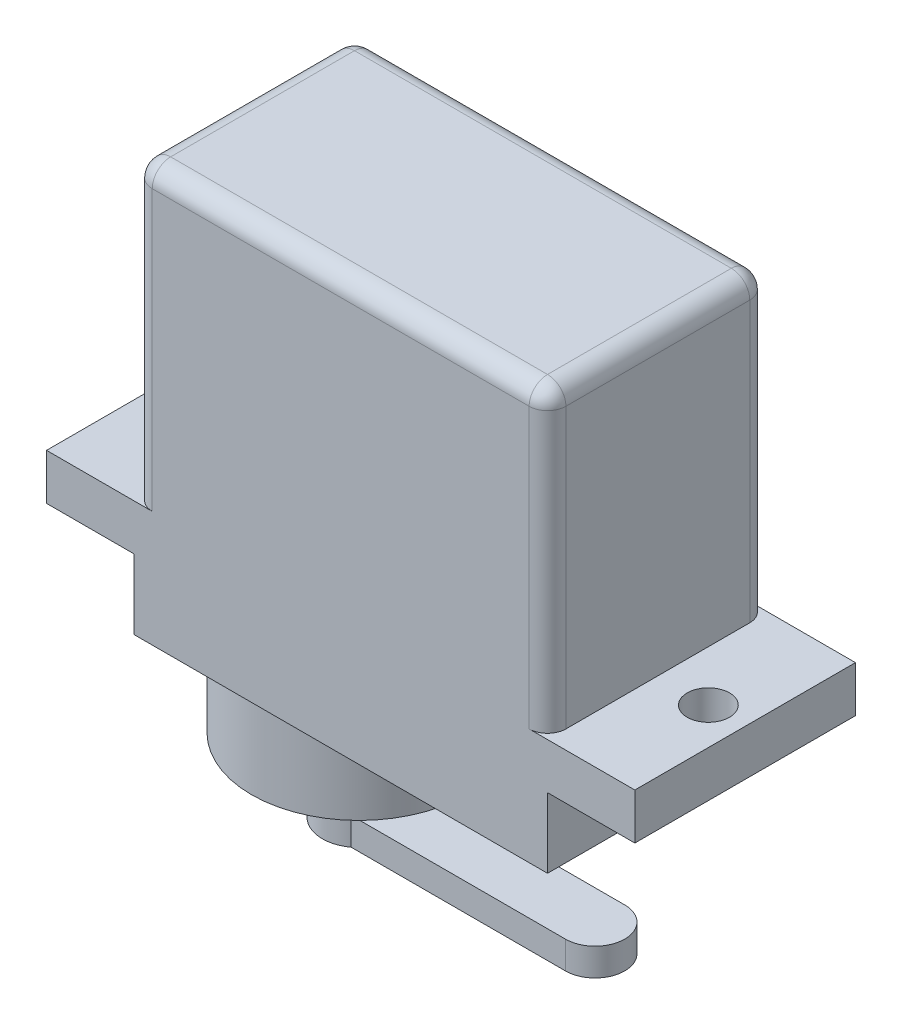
ISO-10303-21;
HEADER;
FILE_DESCRIPTION(('STEP AP214'),'2;1');
FILE_NAME('part.step','',(''),(''),'','','');
FILE_SCHEMA(('AUTOMOTIVE_DESIGN { 1 0 10303 214 1 1 1 1 }'));
ENDSEC;
DATA;
#1=APPLICATION_CONTEXT('core data for automotive mechanical design processes');
#2=APPLICATION_PROTOCOL_DEFINITION('international standard','automotive_design',2000,#1);
#3=PRODUCT_CONTEXT('',#1,'mechanical');
#4=PRODUCT('Part','Part','',(#3));
#5=PRODUCT_RELATED_PRODUCT_CATEGORY('part','',(#4));
#6=PRODUCT_DEFINITION_FORMATION('','',#4);
#7=PRODUCT_DEFINITION_CONTEXT('part definition',#1,'design');
#8=PRODUCT_DEFINITION('design','',#6,#7);
#9=PRODUCT_DEFINITION_SHAPE('','',#8);
#10=(LENGTH_UNIT() NAMED_UNIT(*) SI_UNIT(.MILLI.,.METRE.));
#11=(NAMED_UNIT(*) PLANE_ANGLE_UNIT() SI_UNIT($,.RADIAN.));
#12=(NAMED_UNIT(*) SI_UNIT($,.STERADIAN.) SOLID_ANGLE_UNIT());
#13=UNCERTAINTY_MEASURE_WITH_UNIT(LENGTH_MEASURE(1.E-05),#10,'distance_accuracy_value','');
#14=(GEOMETRIC_REPRESENTATION_CONTEXT(3) GLOBAL_UNCERTAINTY_ASSIGNED_CONTEXT((#13)) GLOBAL_UNIT_ASSIGNED_CONTEXT((#10,
#11,#12)) REPRESENTATION_CONTEXT('',''));
#15=CARTESIAN_POINT('',(0.,0.,0.));
#16=DIRECTION('',(0.,0.,1.));
#17=DIRECTION('',(1.,0.,0.));
#18=AXIS2_PLACEMENT_3D('',#15,#16,#17);
#19=CARTESIAN_POINT('',(11.25,3.8,6.));
#20=DIRECTION('',(-1.,0.,0.));
#21=DIRECTION('',(0.,-1.,0.));
#22=AXIS2_PLACEMENT_3D('',#19,#20,#21);
#23=PLANE('',#22);
#24=DIRECTION('',(0.,1.,0.));
#25=VECTOR('',#24,1.);
#26=CARTESIAN_POINT('',(11.25,3.8,-6.));
#27=LINE('',#26,#25);
#28=CARTESIAN_POINT('',(11.25,0.,-6.));
#29=VERTEX_POINT('',#28);
#30=CARTESIAN_POINT('',(11.25,3.8,-6.));
#31=VERTEX_POINT('',#30);
#32=EDGE_CURVE('E268',#29,#31,#27,.T.);
#33=ORIENTED_EDGE('',*,*,#32,.T.);
#34=DIRECTION('',(0.,0.,-1.));
#35=VECTOR('',#34,1.);
#36=CARTESIAN_POINT('',(11.25,3.8,6.));
#37=LINE('',#36,#35);
#38=CARTESIAN_POINT('',(11.25,3.8,6.));
#39=VERTEX_POINT('',#38);
#40=EDGE_CURVE('E307',#39,#31,#37,.T.);
#41=ORIENTED_EDGE('',*,*,#40,.F.);
#42=DIRECTION('',(0.,1.,0.));
#43=VECTOR('',#42,1.);
#44=CARTESIAN_POINT('',(11.25,3.8,6.));
#45=LINE('',#44,#43);
#46=CARTESIAN_POINT('',(11.25,0.,6.));
#47=VERTEX_POINT('',#46);
#48=EDGE_CURVE('E249',#47,#39,#45,.T.);
#49=ORIENTED_EDGE('',*,*,#48,.F.);
#50=DIRECTION('',(0.,0.,-1.));
#51=VECTOR('',#50,1.);
#52=CARTESIAN_POINT('',(11.25,0.,6.));
#53=LINE('',#52,#51);
#54=EDGE_CURVE('E236',#47,#29,#53,.T.);
#55=ORIENTED_EDGE('',*,*,#54,.T.);
#56=EDGE_LOOP('',(#33,#41,#49,#55));
#57=FACE_BOUND('',#56,.T.);
#58=ADVANCED_FACE('F37',(#57),#23,.F.);
#59=CARTESIAN_POINT('',(16.,3.8,6.));
#60=DIRECTION('',(0.,1.,0.));
#61=DIRECTION('',(-1.,0.,0.));
#62=AXIS2_PLACEMENT_3D('',#59,#60,#61);
#63=PLANE('',#62);
#64=CARTESIAN_POINT('',(14.,3.8,0.));
#65=DIRECTION('',(0.,-1.,0.));
#66=DIRECTION('',(-1.,0.,0.));
#67=AXIS2_PLACEMENT_3D('',#64,#65,#66);
#68=CIRCLE('',#67,1.15);
#69=CARTESIAN_POINT('',(12.85,3.8,0.));
#70=VERTEX_POINT('',#69);
#71=EDGE_CURVE('E233',#70,#70,#68,.T.);
#72=ORIENTED_EDGE('',*,*,#71,.F.);
#73=EDGE_LOOP('',(#72));
#74=FACE_BOUND('',#73,.T.);
#75=DIRECTION('',(1.,0.,0.));
#76=VECTOR('',#75,1.);
#77=CARTESIAN_POINT('',(16.,3.8,-6.));
#78=LINE('',#77,#76);
#79=CARTESIAN_POINT('',(16.,3.8,-6.));
#80=VERTEX_POINT('',#79);
#81=EDGE_CURVE('E270',#31,#80,#78,.T.);
#82=ORIENTED_EDGE('',*,*,#81,.T.);
#83=DIRECTION('',(0.,0.,-1.));
#84=VECTOR('',#83,1.);
#85=CARTESIAN_POINT('',(16.,3.8,6.));
#86=LINE('',#85,#84);
#87=CARTESIAN_POINT('',(16.,3.8,6.));
#88=VERTEX_POINT('',#87);
#89=EDGE_CURVE('E304',#88,#80,#86,.T.);
#90=ORIENTED_EDGE('',*,*,#89,.F.);
#91=DIRECTION('',(1.,0.,0.));
#92=VECTOR('',#91,1.);
#93=CARTESIAN_POINT('',(16.,3.8,6.));
#94=LINE('',#93,#92);
#95=EDGE_CURVE('E252',#39,#88,#94,.T.);
#96=ORIENTED_EDGE('',*,*,#95,.F.);
#97=ORIENTED_EDGE('',*,*,#40,.T.);
#98=EDGE_LOOP('',(#82,#90,#96,#97));
#99=FACE_BOUND('',#98,.T.);
#100=ADVANCED_FACE('F454',(#74,#99),#63,.F.);
#101=CARTESIAN_POINT('',(16.,6.3,6.));
#102=DIRECTION('',(-1.,0.,0.));
#103=DIRECTION('',(0.,0.,1.));
#104=AXIS2_PLACEMENT_3D('',#101,#102,#103);
#105=PLANE('',#104);
#106=DIRECTION('',(0.,1.,0.));
#107=VECTOR('',#106,1.);
#108=CARTESIAN_POINT('',(16.,6.3,-6.));
#109=LINE('',#108,#107);
#110=CARTESIAN_POINT('',(16.,6.3,-6.));
#111=VERTEX_POINT('',#110);
#112=EDGE_CURVE('E272',#80,#111,#109,.T.);
#113=ORIENTED_EDGE('',*,*,#112,.T.);
#114=DIRECTION('',(0.,0.,-1.));
#115=VECTOR('',#114,1.);
#116=CARTESIAN_POINT('',(16.,6.3,6.));
#117=LINE('',#116,#115);
#118=CARTESIAN_POINT('',(16.,6.3,6.));
#119=VERTEX_POINT('',#118);
#120=EDGE_CURVE('E301',#119,#111,#117,.T.);
#121=ORIENTED_EDGE('',*,*,#120,.F.);
#122=DIRECTION('',(0.,1.,0.));
#123=VECTOR('',#122,1.);
#124=CARTESIAN_POINT('',(16.,6.3,6.));
#125=LINE('',#124,#123);
#126=EDGE_CURVE('E254',#88,#119,#125,.T.);
#127=ORIENTED_EDGE('',*,*,#126,.F.);
#128=ORIENTED_EDGE('',*,*,#89,.T.);
#129=EDGE_LOOP('',(#113,#121,#127,#128));
#130=FACE_BOUND('',#129,.T.);
#131=ADVANCED_FACE('F460',(#130),#105,.F.);
#132=CARTESIAN_POINT('',(11.25,6.3,6.));
#133=DIRECTION('',(0.,-1.,0.));
#134=DIRECTION('',(1.,0.,0.));
#135=AXIS2_PLACEMENT_3D('',#132,#133,#134);
#136=PLANE('',#135);
#137=CARTESIAN_POINT('',(14.,6.3,0.));
#138=DIRECTION('',(0.,-1.,0.));
#139=DIRECTION('',(1.,0.,0.));
#140=AXIS2_PLACEMENT_3D('',#137,#138,#139);
#141=CIRCLE('',#140,1.15);
#142=CARTESIAN_POINT('',(15.15,6.3,0.));
#143=VERTEX_POINT('',#142);
#144=EDGE_CURVE('E245',#143,#143,#141,.T.);
#145=ORIENTED_EDGE('',*,*,#144,.T.);
#146=EDGE_LOOP('',(#145));
#147=FACE_BOUND('',#146,.T.);
#148=DIRECTION('',(-1.,0.,0.));
#149=VECTOR('',#148,1.);
#150=CARTESIAN_POINT('',(11.25,6.3,-6.));
#151=LINE('',#150,#149);
#152=CARTESIAN_POINT('',(10.25,6.3,-6.));
#153=VERTEX_POINT('',#152);
#154=EDGE_CURVE('E274',#111,#153,#151,.T.);
#155=ORIENTED_EDGE('',*,*,#154,.T.);
#156=CARTESIAN_POINT('',(10.25,6.3,-5.));
#157=DIRECTION('',(0.,-1.,0.));
#158=DIRECTION('',(1.,0.,0.));
#159=AXIS2_PLACEMENT_3D('',#156,#157,#158);
#160=CIRCLE('',#159,1.);
#161=CARTESIAN_POINT('',(11.25,6.3,-5.));
#162=VERTEX_POINT('',#161);
#163=EDGE_CURVE('E352',#153,#162,#160,.T.);
#164=ORIENTED_EDGE('',*,*,#163,.T.);
#165=DIRECTION('',(0.,0.,-1.));
#166=VECTOR('',#165,1.);
#167=CARTESIAN_POINT('',(11.25,6.3,6.));
#168=LINE('',#167,#166);
#169=CARTESIAN_POINT('',(11.25,6.3,5.));
#170=VERTEX_POINT('',#169);
#171=EDGE_CURVE('E298',#170,#162,#168,.T.);
#172=ORIENTED_EDGE('',*,*,#171,.F.);
#173=CARTESIAN_POINT('',(10.25,6.3,5.));
#174=DIRECTION('',(0.,-1.,0.));
#175=DIRECTION('',(1.,0.,0.));
#176=AXIS2_PLACEMENT_3D('',#173,#174,#175);
#177=CIRCLE('',#176,1.);
#178=CARTESIAN_POINT('',(10.25,6.3,6.));
#179=VERTEX_POINT('',#178);
#180=EDGE_CURVE('E46',#170,#179,#177,.T.);
#181=ORIENTED_EDGE('',*,*,#180,.T.);
#182=DIRECTION('',(-1.,0.,0.));
#183=VECTOR('',#182,1.);
#184=CARTESIAN_POINT('',(11.25,6.3,6.));
#185=LINE('',#184,#183);
#186=EDGE_CURVE('E256',#119,#179,#185,.T.);
#187=ORIENTED_EDGE('',*,*,#186,.F.);
#188=ORIENTED_EDGE('',*,*,#120,.T.);
#189=EDGE_LOOP('',(#155,#164,#172,#181,#187,#188));
#190=FACE_BOUND('',#189,.T.);
#191=ADVANCED_FACE('F702',(#147,#190),#136,.F.);
#192=CARTESIAN_POINT('',(11.25,22.5,6.));
#193=DIRECTION('',(-1.,0.,0.));
#194=DIRECTION('',(0.,0.,1.));
#195=AXIS2_PLACEMENT_3D('',#192,#193,#194);
#196=PLANE('',#195);
#197=ORIENTED_EDGE('',*,*,#171,.T.);
#198=DIRECTION('',(0.,1.,0.));
#199=VECTOR('',#198,1.);
#200=CARTESIAN_POINT('',(11.25,22.5,-5.));
#201=LINE('',#200,#199);
#202=CARTESIAN_POINT('',(11.25,21.5,-5.));
#203=VERTEX_POINT('',#202);
#204=EDGE_CURVE('E329',#162,#203,#201,.T.);
#205=ORIENTED_EDGE('',*,*,#204,.T.);
#206=DIRECTION('',(0.,0.,-1.));
#207=VECTOR('',#206,1.);
#208=CARTESIAN_POINT('',(11.25,21.5,6.));
#209=LINE('',#208,#207);
#210=CARTESIAN_POINT('',(11.25,21.5,5.));
#211=VERTEX_POINT('',#210);
#212=EDGE_CURVE('E326',#203,#211,#209,.F.);
#213=ORIENTED_EDGE('',*,*,#212,.T.);
#214=DIRECTION('',(0.,1.,0.));
#215=VECTOR('',#214,1.);
#216=CARTESIAN_POINT('',(11.25,22.5,5.));
#217=LINE('',#216,#215);
#218=EDGE_CURVE('E324',#211,#170,#217,.F.);
#219=ORIENTED_EDGE('',*,*,#218,.T.);
#220=EDGE_LOOP('',(#197,#205,#213,#219));
#221=FACE_BOUND('',#220,.T.);
#222=ADVANCED_FACE('F714',(#221),#196,.F.);
#223=CARTESIAN_POINT('',(-11.25,22.5,6.));
#224=DIRECTION('',(0.,-1.,0.));
#225=DIRECTION('',(0.,0.,-1.));
#226=AXIS2_PLACEMENT_3D('',#223,#224,#225);
#227=PLANE('',#226);
#228=DIRECTION('',(-1.,0.,0.));
#229=VECTOR('',#228,1.);
#230=CARTESIAN_POINT('',(-11.25,22.5,5.));
#231=LINE('',#230,#229);
#232=CARTESIAN_POINT('',(-10.25,22.5,5.));
#233=VERTEX_POINT('',#232);
#234=CARTESIAN_POINT('',(10.25,22.5,5.));
#235=VERTEX_POINT('',#234);
#236=EDGE_CURVE('E319',#233,#235,#231,.F.);
#237=ORIENTED_EDGE('',*,*,#236,.T.);
#238=DIRECTION('',(0.,0.,-1.));
#239=VECTOR('',#238,1.);
#240=CARTESIAN_POINT('',(10.25,22.5,6.));
#241=LINE('',#240,#239);
#242=CARTESIAN_POINT('',(10.25,22.5,-5.));
#243=VERTEX_POINT('',#242);
#244=EDGE_CURVE('E321',#235,#243,#241,.T.);
#245=ORIENTED_EDGE('',*,*,#244,.T.);
#246=DIRECTION('',(-1.,0.,0.));
#247=VECTOR('',#246,1.);
#248=CARTESIAN_POINT('',(-11.25,22.5,-5.));
#249=LINE('',#248,#247);
#250=CARTESIAN_POINT('',(-10.25,22.5,-5.));
#251=VERTEX_POINT('',#250);
#252=EDGE_CURVE('E315',#243,#251,#249,.T.);
#253=ORIENTED_EDGE('',*,*,#252,.T.);
#254=DIRECTION('',(0.,0.,-1.));
#255=VECTOR('',#254,1.);
#256=CARTESIAN_POINT('',(-10.25,22.5,6.));
#257=LINE('',#256,#255);
#258=EDGE_CURVE('E317',#251,#233,#257,.F.);
#259=ORIENTED_EDGE('',*,*,#258,.T.);
#260=EDGE_LOOP('',(#237,#245,#253,#259));
#261=FACE_BOUND('',#260,.T.);
#262=ADVANCED_FACE('F402',(#261),#227,.F.);
#263=CARTESIAN_POINT('',(-11.25,6.3,6.));
#264=DIRECTION('',(1.,0.,0.));
#265=DIRECTION('',(0.,0.,-1.));
#266=AXIS2_PLACEMENT_3D('',#263,#264,#265);
#267=PLANE('',#266);
#268=DIRECTION('',(0.,0.,-1.));
#269=VECTOR('',#268,1.);
#270=CARTESIAN_POINT('',(-11.25,21.5,6.));
#271=LINE('',#270,#269);
#272=CARTESIAN_POINT('',(-11.25,21.5,5.));
#273=VERTEX_POINT('',#272);
#274=CARTESIAN_POINT('',(-11.25,21.5,-5.));
#275=VERTEX_POINT('',#274);
#276=EDGE_CURVE('E340',#273,#275,#271,.T.);
#277=ORIENTED_EDGE('',*,*,#276,.T.);
#278=DIRECTION('',(0.,-1.,0.));
#279=VECTOR('',#278,1.);
#280=CARTESIAN_POINT('',(-11.25,6.3,-5.));
#281=LINE('',#280,#279);
#282=CARTESIAN_POINT('',(-11.25,6.3,-5.));
#283=VERTEX_POINT('',#282);
#284=EDGE_CURVE('E342',#275,#283,#281,.T.);
#285=ORIENTED_EDGE('',*,*,#284,.T.);
#286=DIRECTION('',(0.,0.,-1.));
#287=VECTOR('',#286,1.);
#288=CARTESIAN_POINT('',(-11.25,6.3,6.));
#289=LINE('',#288,#287);
#290=CARTESIAN_POINT('',(-11.25,6.3,5.));
#291=VERTEX_POINT('',#290);
#292=EDGE_CURVE('E295',#291,#283,#289,.T.);
#293=ORIENTED_EDGE('',*,*,#292,.F.);
#294=DIRECTION('',(0.,-1.,0.));
#295=VECTOR('',#294,1.);
#296=CARTESIAN_POINT('',(-11.25,6.3,5.));
#297=LINE('',#296,#295);
#298=EDGE_CURVE('E338',#291,#273,#297,.F.);
#299=ORIENTED_EDGE('',*,*,#298,.T.);
#300=EDGE_LOOP('',(#277,#285,#293,#299));
#301=FACE_BOUND('',#300,.T.);
#302=ADVANCED_FACE('F412',(#301),#267,.F.);
#303=CARTESIAN_POINT('',(-16.,6.3,6.));
#304=DIRECTION('',(0.,-1.,0.));
#305=DIRECTION('',(1.,0.,0.));
#306=AXIS2_PLACEMENT_3D('',#303,#304,#305);
#307=PLANE('',#306);
#308=CARTESIAN_POINT('',(-14.,6.3,0.));
#309=DIRECTION('',(0.,-1.,0.));
#310=DIRECTION('',(1.,0.,0.));
#311=AXIS2_PLACEMENT_3D('',#308,#309,#310);
#312=CIRCLE('',#311,1.15);
#313=CARTESIAN_POINT('',(-12.85,6.3,0.));
#314=VERTEX_POINT('',#313);
#315=EDGE_CURVE('E240',#314,#314,#312,.T.);
#316=ORIENTED_EDGE('',*,*,#315,.T.);
#317=EDGE_LOOP('',(#316));
#318=FACE_BOUND('',#317,.T.);
#319=DIRECTION('',(-1.,0.,0.));
#320=VECTOR('',#319,1.);
#321=CARTESIAN_POINT('',(-16.,6.3,-6.));
#322=LINE('',#321,#320);
#323=CARTESIAN_POINT('',(-10.25,6.3,-6.));
#324=VERTEX_POINT('',#323);
#325=CARTESIAN_POINT('',(-16.,6.3,-6.));
#326=VERTEX_POINT('',#325);
#327=EDGE_CURVE('E54',#324,#326,#322,.T.);
#328=ORIENTED_EDGE('',*,*,#327,.T.);
#329=DIRECTION('',(0.,0.,-1.));
#330=VECTOR('',#329,1.);
#331=CARTESIAN_POINT('',(-16.,6.3,6.));
#332=LINE('',#331,#330);
#333=CARTESIAN_POINT('',(-16.,6.3,6.));
#334=VERTEX_POINT('',#333);
#335=EDGE_CURVE('E292',#334,#326,#332,.T.);
#336=ORIENTED_EDGE('',*,*,#335,.F.);
#337=DIRECTION('',(-1.,0.,0.));
#338=VECTOR('',#337,1.);
#339=CARTESIAN_POINT('',(-16.,6.3,6.));
#340=LINE('',#339,#338);
#341=CARTESIAN_POINT('',(-10.25,6.3,6.));
#342=VERTEX_POINT('',#341);
#343=EDGE_CURVE('E258',#342,#334,#340,.T.);
#344=ORIENTED_EDGE('',*,*,#343,.F.);
#345=CARTESIAN_POINT('',(-10.25,6.3,5.));
#346=DIRECTION('',(0.,-1.,0.));
#347=DIRECTION('',(1.,0.,0.));
#348=AXIS2_PLACEMENT_3D('',#345,#346,#347);
#349=CIRCLE('',#348,1.);
#350=EDGE_CURVE('E11',#342,#291,#349,.T.);
#351=ORIENTED_EDGE('',*,*,#350,.T.);
#352=ORIENTED_EDGE('',*,*,#292,.T.);
#353=CARTESIAN_POINT('',(-10.25,6.3,-5.));
#354=DIRECTION('',(0.,-1.,0.));
#355=DIRECTION('',(1.,0.,0.));
#356=AXIS2_PLACEMENT_3D('',#353,#354,#355);
#357=CIRCLE('',#356,1.);
#358=EDGE_CURVE('E350',#283,#324,#357,.T.);
#359=ORIENTED_EDGE('',*,*,#358,.T.);
#360=EDGE_LOOP('',(#328,#336,#344,#351,#352,#359));
#361=FACE_BOUND('',#360,.T.);
#362=ADVANCED_FACE('F419',(#318,#361),#307,.F.);
#363=CARTESIAN_POINT('',(-16.,3.8,6.));
#364=DIRECTION('',(1.,0.,0.));
#365=DIRECTION('',(0.,0.,-1.));
#366=AXIS2_PLACEMENT_3D('',#363,#364,#365);
#367=PLANE('',#366);
#368=DIRECTION('',(0.,-1.,0.));
#369=VECTOR('',#368,1.);
#370=CARTESIAN_POINT('',(-16.,3.8,-6.));
#371=LINE('',#370,#369);
#372=CARTESIAN_POINT('',(-16.,3.8,-6.));
#373=VERTEX_POINT('',#372);
#374=EDGE_CURVE('E277',#326,#373,#371,.T.);
#375=ORIENTED_EDGE('',*,*,#374,.T.);
#376=DIRECTION('',(0.,0.,-1.));
#377=VECTOR('',#376,1.);
#378=CARTESIAN_POINT('',(-16.,3.8,6.));
#379=LINE('',#378,#377);
#380=CARTESIAN_POINT('',(-16.,3.8,6.));
#381=VERTEX_POINT('',#380);
#382=EDGE_CURVE('E289',#381,#373,#379,.T.);
#383=ORIENTED_EDGE('',*,*,#382,.F.);
#384=DIRECTION('',(0.,-1.,0.));
#385=VECTOR('',#384,1.);
#386=CARTESIAN_POINT('',(-16.,3.8,6.));
#387=LINE('',#386,#385);
#388=EDGE_CURVE('E260',#334,#381,#387,.T.);
#389=ORIENTED_EDGE('',*,*,#388,.F.);
#390=ORIENTED_EDGE('',*,*,#335,.T.);
#391=EDGE_LOOP('',(#375,#383,#389,#390));
#392=FACE_BOUND('',#391,.T.);
#393=ADVANCED_FACE('F667',(#392),#367,.F.);
#394=CARTESIAN_POINT('',(-11.25,3.8,6.));
#395=DIRECTION('',(0.,1.,0.));
#396=DIRECTION('',(-1.,0.,0.));
#397=AXIS2_PLACEMENT_3D('',#394,#395,#396);
#398=PLANE('',#397);
#399=CARTESIAN_POINT('',(-14.,3.80000000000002,0.));
#400=DIRECTION('',(0.,-1.,0.));
#401=DIRECTION('',(1.,0.,0.));
#402=AXIS2_PLACEMENT_3D('',#399,#400,#401);
#403=CIRCLE('',#402,1.15);
#404=CARTESIAN_POINT('',(-12.85,3.80000000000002,0.));
#405=VERTEX_POINT('',#404);
#406=EDGE_CURVE('E237',#405,#405,#403,.T.);
#407=ORIENTED_EDGE('',*,*,#406,.F.);
#408=EDGE_LOOP('',(#407));
#409=FACE_BOUND('',#408,.T.);
#410=DIRECTION('',(1.,0.,0.));
#411=VECTOR('',#410,1.);
#412=CARTESIAN_POINT('',(-11.25,3.8,-6.));
#413=LINE('',#412,#411);
#414=CARTESIAN_POINT('',(-11.25,3.8,-6.));
#415=VERTEX_POINT('',#414);
#416=EDGE_CURVE('E279',#373,#415,#413,.T.);
#417=ORIENTED_EDGE('',*,*,#416,.T.);
#418=DIRECTION('',(0.,0.,-1.));
#419=VECTOR('',#418,1.);
#420=CARTESIAN_POINT('',(-11.25,3.8,6.));
#421=LINE('',#420,#419);
#422=CARTESIAN_POINT('',(-11.25,3.8,6.));
#423=VERTEX_POINT('',#422);
#424=EDGE_CURVE('E286',#423,#415,#421,.T.);
#425=ORIENTED_EDGE('',*,*,#424,.F.);
#426=DIRECTION('',(1.,0.,0.));
#427=VECTOR('',#426,1.);
#428=CARTESIAN_POINT('',(-11.25,3.8,6.));
#429=LINE('',#428,#427);
#430=EDGE_CURVE('E262',#381,#423,#429,.T.);
#431=ORIENTED_EDGE('',*,*,#430,.F.);
#432=ORIENTED_EDGE('',*,*,#382,.T.);
#433=EDGE_LOOP('',(#417,#425,#431,#432));
#434=FACE_BOUND('',#433,.T.);
#435=ADVANCED_FACE('F662',(#409,#434),#398,.F.);
#436=CARTESIAN_POINT('',(-11.25,0.,6.));
#437=DIRECTION('',(1.,0.,0.));
#438=DIRECTION('',(0.,1.,0.));
#439=AXIS2_PLACEMENT_3D('',#436,#437,#438);
#440=PLANE('',#439);
#441=DIRECTION('',(0.,-1.,0.));
#442=VECTOR('',#441,1.);
#443=CARTESIAN_POINT('',(-11.25,0.,-6.));
#444=LINE('',#443,#442);
#445=CARTESIAN_POINT('',(-11.25,0.,-6.));
#446=VERTEX_POINT('',#445);
#447=EDGE_CURVE('E281',#415,#446,#444,.T.);
#448=ORIENTED_EDGE('',*,*,#447,.T.);
#449=DIRECTION('',(0.,0.,-1.));
#450=VECTOR('',#449,1.);
#451=CARTESIAN_POINT('',(-11.25,0.,6.));
#452=LINE('',#451,#450);
#453=CARTESIAN_POINT('',(-11.25,0.,6.));
#454=VERTEX_POINT('',#453);
#455=EDGE_CURVE('E267',#454,#446,#452,.T.);
#456=ORIENTED_EDGE('',*,*,#455,.F.);
#457=DIRECTION('',(0.,-1.,0.));
#458=VECTOR('',#457,1.);
#459=CARTESIAN_POINT('',(-11.25,0.,6.));
#460=LINE('',#459,#458);
#461=EDGE_CURVE('E264',#423,#454,#460,.T.);
#462=ORIENTED_EDGE('',*,*,#461,.F.);
#463=ORIENTED_EDGE('',*,*,#424,.T.);
#464=EDGE_LOOP('',(#448,#456,#462,#463));
#465=FACE_BOUND('',#464,.T.);
#466=ADVANCED_FACE('F632',(#465),#440,.F.);
#467=CARTESIAN_POINT('',(0.,0.,6.));
#468=DIRECTION('',(0.,1.,0.));
#469=DIRECTION('',(-1.,0.,0.));
#470=AXIS2_PLACEMENT_3D('',#467,#468,#469);
#471=PLANE('',#470);
#472=CARTESIAN_POINT('',(-5.,0.,0.));
#473=DIRECTION('',(0.,-1.,0.));
#474=DIRECTION('',(1.,0.,0.));
#475=AXIS2_PLACEMENT_3D('',#472,#473,#474);
#476=CIRCLE('',#475,5.85);
#477=CARTESIAN_POINT('',(0.849999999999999,0.,0.));
#478=VERTEX_POINT('',#477);
#479=EDGE_CURVE('E230',#478,#478,#476,.T.);
#480=ORIENTED_EDGE('',*,*,#479,.F.);
#481=EDGE_LOOP('',(#480));
#482=FACE_BOUND('',#481,.T.);
#483=DIRECTION('',(1.,0.,0.));
#484=VECTOR('',#483,1.);
#485=CARTESIAN_POINT('',(0.,0.,-6.));
#486=LINE('',#485,#484);
#487=EDGE_CURVE('E250',#446,#29,#486,.T.);
#488=ORIENTED_EDGE('',*,*,#487,.T.);
#489=ORIENTED_EDGE('',*,*,#54,.F.);
#490=DIRECTION('',(1.,0.,0.));
#491=VECTOR('',#490,1.);
#492=CARTESIAN_POINT('',(11.25,0.,6.));
#493=LINE('',#492,#491);
#494=EDGE_CURVE('E246',#454,#47,#493,.T.);
#495=ORIENTED_EDGE('',*,*,#494,.F.);
#496=ORIENTED_EDGE('',*,*,#455,.T.);
#497=EDGE_LOOP('',(#488,#489,#495,#496));
#498=FACE_BOUND('',#497,.T.);
#499=ADVANCED_FACE('F627',(#482,#498),#471,.F.);
#500=CARTESIAN_POINT('',(0.,0.,6.));
#501=DIRECTION('',(0.,0.,-1.));
#502=DIRECTION('',(-1.,0.,0.));
#503=AXIS2_PLACEMENT_3D('',#500,#501,#502);
#504=PLANE('',#503);
#505=ORIENTED_EDGE('',*,*,#186,.T.);
#506=DIRECTION('',(0.,1.,0.));
#507=VECTOR('',#506,1.);
#508=CARTESIAN_POINT('',(10.25,0.,6.));
#509=LINE('',#508,#507);
#510=CARTESIAN_POINT('',(10.25,21.5,6.));
#511=VERTEX_POINT('',#510);
#512=EDGE_CURVE('E336',#179,#511,#509,.T.);
#513=ORIENTED_EDGE('',*,*,#512,.T.);
#514=DIRECTION('',(-1.,0.,0.));
#515=VECTOR('',#514,1.);
#516=CARTESIAN_POINT('',(0.,21.5,6.));
#517=LINE('',#516,#515);
#518=CARTESIAN_POINT('',(-10.25,21.5,6.));
#519=VERTEX_POINT('',#518);
#520=EDGE_CURVE('E334',#511,#519,#517,.T.);
#521=ORIENTED_EDGE('',*,*,#520,.T.);
#522=DIRECTION('',(0.,-1.,0.));
#523=VECTOR('',#522,1.);
#524=CARTESIAN_POINT('',(-10.25,0.,6.));
#525=LINE('',#524,#523);
#526=EDGE_CURVE('E331',#519,#342,#525,.T.);
#527=ORIENTED_EDGE('',*,*,#526,.T.);
#528=ORIENTED_EDGE('',*,*,#343,.T.);
#529=ORIENTED_EDGE('',*,*,#388,.T.);
#530=ORIENTED_EDGE('',*,*,#430,.T.);
#531=ORIENTED_EDGE('',*,*,#461,.T.);
#532=ORIENTED_EDGE('',*,*,#494,.T.);
#533=ORIENTED_EDGE('',*,*,#48,.T.);
#534=ORIENTED_EDGE('',*,*,#95,.T.);
#535=ORIENTED_EDGE('',*,*,#126,.T.);
#536=EDGE_LOOP('',(#505,#513,#521,#527,#528,#529,#530,#531,#532,#533,#534,#535));
#537=FACE_BOUND('',#536,.T.);
#538=ADVANCED_FACE('F423',(#537),#504,.F.);
#539=CARTESIAN_POINT('',(0.,0.,-6.));
#540=DIRECTION('',(0.,0.,-1.));
#541=DIRECTION('',(-1.,0.,0.));
#542=AXIS2_PLACEMENT_3D('',#539,#540,#541);
#543=PLANE('',#542);
#544=ORIENTED_EDGE('',*,*,#327,.F.);
#545=DIRECTION('',(0.,-1.,0.));
#546=VECTOR('',#545,1.);
#547=CARTESIAN_POINT('',(-10.25,22.5,-6.));
#548=LINE('',#547,#546);
#549=CARTESIAN_POINT('',(-10.25,21.5,-6.));
#550=VERTEX_POINT('',#549);
#551=EDGE_CURVE('E59',#324,#550,#548,.F.);
#552=ORIENTED_EDGE('',*,*,#551,.T.);
#553=DIRECTION('',(-1.,0.,0.));
#554=VECTOR('',#553,1.);
#555=CARTESIAN_POINT('',(11.25,21.5,-6.));
#556=LINE('',#555,#554);
#557=CARTESIAN_POINT('',(10.25,21.5,-6.));
#558=VERTEX_POINT('',#557);
#559=EDGE_CURVE('E347',#550,#558,#556,.F.);
#560=ORIENTED_EDGE('',*,*,#559,.T.);
#561=DIRECTION('',(0.,1.,0.));
#562=VECTOR('',#561,1.);
#563=CARTESIAN_POINT('',(10.25,6.3,-6.));
#564=LINE('',#563,#562);
#565=EDGE_CURVE('E344',#558,#153,#564,.F.);
#566=ORIENTED_EDGE('',*,*,#565,.T.);
#567=ORIENTED_EDGE('',*,*,#154,.F.);
#568=ORIENTED_EDGE('',*,*,#112,.F.);
#569=ORIENTED_EDGE('',*,*,#81,.F.);
#570=ORIENTED_EDGE('',*,*,#32,.F.);
#571=ORIENTED_EDGE('',*,*,#487,.F.);
#572=ORIENTED_EDGE('',*,*,#447,.F.);
#573=ORIENTED_EDGE('',*,*,#416,.F.);
#574=ORIENTED_EDGE('',*,*,#374,.F.);
#575=EDGE_LOOP('',(#544,#552,#560,#566,#567,#568,#569,#570,#571,#572,#573,#574));
#576=FACE_BOUND('',#575,.T.);
#577=ADVANCED_FACE('F654',(#576),#543,.T.);
#578=CARTESIAN_POINT('',(-14.,22.5,0.));
#579=DIRECTION('',(0.,-1.,0.));
#580=DIRECTION('',(1.,0.,0.));
#581=AXIS2_PLACEMENT_3D('',#578,#579,#580);
#582=CYLINDRICAL_SURFACE('',#581,1.15);
#583=ORIENTED_EDGE('',*,*,#406,.T.);
#584=EDGE_LOOP('',(#583));
#585=FACE_BOUND('',#584,.T.);
#586=ORIENTED_EDGE('',*,*,#315,.F.);
#587=EDGE_LOOP('',(#586));
#588=FACE_BOUND('',#587,.T.);
#589=ADVANCED_FACE('F644',(#585,#588),#582,.F.);
#590=CARTESIAN_POINT('',(14.,22.5,0.));
#591=DIRECTION('',(0.,-1.,0.));
#592=DIRECTION('',(1.,0.,0.));
#593=AXIS2_PLACEMENT_3D('',#590,#591,#592);
#594=CYLINDRICAL_SURFACE('',#593,1.15);
#595=ORIENTED_EDGE('',*,*,#71,.T.);
#596=EDGE_LOOP('',(#595));
#597=FACE_BOUND('',#596,.T.);
#598=ORIENTED_EDGE('',*,*,#144,.F.);
#599=EDGE_LOOP('',(#598));
#600=FACE_BOUND('',#599,.T.);
#601=ADVANCED_FACE('F619',(#597,#600),#594,.F.);
#602=CARTESIAN_POINT('',(-5.,-4.5,0.));
#603=DIRECTION('',(0.,1.,0.));
#604=DIRECTION('',(-1.,0.,0.));
#605=AXIS2_PLACEMENT_3D('',#602,#603,#604);
#606=CYLINDRICAL_SURFACE('',#605,5.85);
#607=CARTESIAN_POINT('',(-5.,-4.5,0.));
#608=DIRECTION('',(0.,-1.,0.));
#609=DIRECTION('',(1.,0.,0.));
#610=AXIS2_PLACEMENT_3D('',#607,#608,#609);
#611=CIRCLE('',#610,5.85);
#612=CARTESIAN_POINT('',(0.85,-4.5,0.));
#613=VERTEX_POINT('',#612);
#614=EDGE_CURVE('E225',#613,#613,#611,.T.);
#615=ORIENTED_EDGE('',*,*,#614,.F.);
#616=EDGE_LOOP('',(#615));
#617=FACE_BOUND('',#616,.T.);
#618=ORIENTED_EDGE('',*,*,#479,.T.);
#619=EDGE_LOOP('',(#618));
#620=FACE_BOUND('',#619,.T.);
#621=ADVANCED_FACE('F609',(#617,#620),#606,.T.);
#622=CARTESIAN_POINT('',(-5.,-4.5,0.));
#623=DIRECTION('',(0.,-1.,0.));
#624=DIRECTION('',(1.,0.,0.));
#625=AXIS2_PLACEMENT_3D('',#622,#623,#624);
#626=PLANE('',#625);
#627=CARTESIAN_POINT('',(-5.,-4.5,0.));
#628=DIRECTION('',(0.,-1.,0.));
#629=DIRECTION('',(1.,0.,0.));
#630=AXIS2_PLACEMENT_3D('',#627,#628,#629);
#631=CIRCLE('',#630,2.);
#632=CARTESIAN_POINT('',(-3.,-4.5,0.));
#633=VERTEX_POINT('',#632);
#634=EDGE_CURVE('E226',#633,#633,#631,.T.);
#635=ORIENTED_EDGE('',*,*,#634,.F.);
#636=EDGE_LOOP('',(#635));
#637=FACE_BOUND('',#636,.T.);
#638=ORIENTED_EDGE('',*,*,#614,.T.);
#639=EDGE_LOOP('',(#638));
#640=FACE_BOUND('',#639,.T.);
#641=ADVANCED_FACE('F599',(#637,#640),#626,.T.);
#642=CARTESIAN_POINT('',(-5.,-8.5,0.));
#643=DIRECTION('',(0.,1.,0.));
#644=DIRECTION('',(-1.,0.,0.));
#645=AXIS2_PLACEMENT_3D('',#642,#643,#644);
#646=CYLINDRICAL_SURFACE('',#645,2.);
#647=CARTESIAN_POINT('',(-5.,-8.5,0.));
#648=DIRECTION('',(0.,-1.,0.));
#649=DIRECTION('',(1.,0.,0.));
#650=AXIS2_PLACEMENT_3D('',#647,#648,#649);
#651=CIRCLE('',#650,2.);
#652=CARTESIAN_POINT('',(-3.81554135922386,-8.5,1.61153893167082));
#653=VERTEX_POINT('',#652);
#654=CARTESIAN_POINT('',(-3.81554135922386,-8.5,-1.61153893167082));
#655=VERTEX_POINT('',#654);
#656=EDGE_CURVE('E222',#653,#655,#651,.T.);
#657=ORIENTED_EDGE('',*,*,#656,.F.);
#658=DIRECTION('',(0.,1.,0.));
#659=VECTOR('',#658,1.);
#660=CARTESIAN_POINT('',(-3.81554135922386,-8.5,1.61153893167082));
#661=LINE('',#660,#659);
#662=CARTESIAN_POINT('',(-3.81554135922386,-7.,1.61153893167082));
#663=VERTEX_POINT('',#662);
#664=EDGE_CURVE('E219',#653,#663,#661,.T.);
#665=ORIENTED_EDGE('',*,*,#664,.T.);
#666=CARTESIAN_POINT('',(-5.,-7.,0.));
#667=DIRECTION('',(0.,-1.,0.));
#668=DIRECTION('',(1.,0.,0.));
#669=AXIS2_PLACEMENT_3D('',#666,#667,#668);
#670=CIRCLE('',#669,2.);
#671=CARTESIAN_POINT('',(-3.81554135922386,-7.,-1.61153893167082));
#672=VERTEX_POINT('',#671);
#673=EDGE_CURVE('E229',#672,#663,#670,.T.);
#674=ORIENTED_EDGE('',*,*,#673,.F.);
#675=DIRECTION('',(0.,1.,0.));
#676=VECTOR('',#675,1.);
#677=CARTESIAN_POINT('',(-3.81554135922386,-8.5,-1.61153893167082));
#678=LINE('',#677,#676);
#679=EDGE_CURVE('E192',#672,#655,#678,.F.);
#680=ORIENTED_EDGE('',*,*,#679,.T.);
#681=EDGE_LOOP('',(#657,#665,#674,#680));
#682=FACE_BOUND('',#681,.T.);
#683=ORIENTED_EDGE('',*,*,#634,.T.);
#684=EDGE_LOOP('',(#683));
#685=FACE_BOUND('',#684,.T.);
#686=ADVANCED_FACE('F587',(#682,#685),#646,.T.);
#687=CARTESIAN_POINT('',(-5.,-8.5,0.));
#688=DIRECTION('',(0.,-1.,0.));
#689=DIRECTION('',(1.,0.,0.));
#690=AXIS2_PLACEMENT_3D('',#687,#688,#689);
#691=PLANE('',#690);
#692=ORIENTED_EDGE('',*,*,#656,.T.);
#693=DIRECTION('',(1.,0.,0.));
#694=VECTOR('',#693,1.);
#695=CARTESIAN_POINT('',(-5.,-8.5,-1.61153893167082));
#696=LINE('',#695,#694);
#697=CARTESIAN_POINT('',(7.83793934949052,-8.5,-1.61153893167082));
#698=VERTEX_POINT('',#697);
#699=EDGE_CURVE('E213',#655,#698,#696,.T.);
#700=ORIENTED_EDGE('',*,*,#699,.T.);
#701=CARTESIAN_POINT('',(7.83793934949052,-8.5,0.));
#702=DIRECTION('',(0.,-1.,0.));
#703=DIRECTION('',(1.,0.,0.));
#704=AXIS2_PLACEMENT_3D('',#701,#702,#703);
#705=CIRCLE('',#704,1.61153893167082);
#706=CARTESIAN_POINT('',(7.83793934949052,-8.5,1.61153893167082));
#707=VERTEX_POINT('',#706);
#708=EDGE_CURVE('E204',#698,#707,#705,.T.);
#709=ORIENTED_EDGE('',*,*,#708,.T.);
#710=DIRECTION('',(-1.,0.,0.));
#711=VECTOR('',#710,1.);
#712=CARTESIAN_POINT('',(-5.,-8.5,1.61153893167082));
#713=LINE('',#712,#711);
#714=EDGE_CURVE('E197',#707,#653,#713,.T.);
#715=ORIENTED_EDGE('',*,*,#714,.T.);
#716=EDGE_LOOP('',(#692,#700,#709,#715));
#717=FACE_BOUND('',#716,.T.);
#718=ADVANCED_FACE('F578',(#717),#691,.T.);
#719=CARTESIAN_POINT('',(-5.,-7.,1.61153893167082));
#720=DIRECTION('',(0.,0.,1.));
#721=DIRECTION('',(1.,0.,0.));
#722=AXIS2_PLACEMENT_3D('',#719,#720,#721);
#723=PLANE('',#722);
#724=ORIENTED_EDGE('',*,*,#664,.F.);
#725=ORIENTED_EDGE('',*,*,#714,.F.);
#726=DIRECTION('',(0.,-1.,0.));
#727=VECTOR('',#726,1.);
#728=CARTESIAN_POINT('',(7.83793934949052,-7.,1.61153893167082));
#729=LINE('',#728,#727);
#730=CARTESIAN_POINT('',(7.83793934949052,-7.,1.61153893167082));
#731=VERTEX_POINT('',#730);
#732=EDGE_CURVE('E205',#731,#707,#729,.T.);
#733=ORIENTED_EDGE('',*,*,#732,.F.);
#734=DIRECTION('',(-1.,0.,0.));
#735=VECTOR('',#734,1.);
#736=CARTESIAN_POINT('',(-5.,-7.,1.61153893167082));
#737=LINE('',#736,#735);
#738=EDGE_CURVE('E206',#731,#663,#737,.T.);
#739=ORIENTED_EDGE('',*,*,#738,.T.);
#740=EDGE_LOOP('',(#724,#725,#733,#739));
#741=FACE_BOUND('',#740,.T.);
#742=ADVANCED_FACE('F570',(#741),#723,.T.);
#743=CARTESIAN_POINT('',(-5.,-7.,-1.61153893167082));
#744=DIRECTION('',(0.,0.,-1.));
#745=DIRECTION('',(-1.,0.,0.));
#746=AXIS2_PLACEMENT_3D('',#743,#744,#745);
#747=PLANE('',#746);
#748=ORIENTED_EDGE('',*,*,#679,.F.);
#749=DIRECTION('',(1.,0.,0.));
#750=VECTOR('',#749,1.);
#751=CARTESIAN_POINT('',(-5.,-7.,-1.61153893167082));
#752=LINE('',#751,#750);
#753=CARTESIAN_POINT('',(7.83793934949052,-7.,-1.61153893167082));
#754=VERTEX_POINT('',#753);
#755=EDGE_CURVE('E186',#672,#754,#752,.T.);
#756=ORIENTED_EDGE('',*,*,#755,.T.);
#757=DIRECTION('',(0.,-1.,0.));
#758=VECTOR('',#757,1.);
#759=CARTESIAN_POINT('',(7.83793934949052,-7.,-1.61153893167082));
#760=LINE('',#759,#758);
#761=EDGE_CURVE('E189',#754,#698,#760,.T.);
#762=ORIENTED_EDGE('',*,*,#761,.T.);
#763=ORIENTED_EDGE('',*,*,#699,.F.);
#764=EDGE_LOOP('',(#748,#756,#762,#763));
#765=FACE_BOUND('',#764,.T.);
#766=ADVANCED_FACE('F188',(#765),#747,.T.);
#767=CARTESIAN_POINT('',(7.83793934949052,-7.,0.));
#768=DIRECTION('',(0.,-1.,0.));
#769=DIRECTION('',(1.,0.,0.));
#770=AXIS2_PLACEMENT_3D('',#767,#768,#769);
#771=CYLINDRICAL_SURFACE('',#770,1.61153893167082);
#772=ORIENTED_EDGE('',*,*,#708,.F.);
#773=ORIENTED_EDGE('',*,*,#761,.F.);
#774=CARTESIAN_POINT('',(7.83793934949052,-7.,0.));
#775=DIRECTION('',(0.,-1.,0.));
#776=DIRECTION('',(1.,0.,0.));
#777=AXIS2_PLACEMENT_3D('',#774,#775,#776);
#778=CIRCLE('',#777,1.61153893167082);
#779=EDGE_CURVE('E196',#754,#731,#778,.T.);
#780=ORIENTED_EDGE('',*,*,#779,.T.);
#781=ORIENTED_EDGE('',*,*,#732,.T.);
#782=EDGE_LOOP('',(#772,#773,#780,#781));
#783=FACE_BOUND('',#782,.T.);
#784=ADVANCED_FACE('F201',(#783),#771,.T.);
#785=CARTESIAN_POINT('',(-5.,-7.,0.));
#786=DIRECTION('',(0.,-1.,0.));
#787=DIRECTION('',(1.,0.,0.));
#788=AXIS2_PLACEMENT_3D('',#785,#786,#787);
#789=PLANE('',#788);
#790=ORIENTED_EDGE('',*,*,#755,.F.);
#791=ORIENTED_EDGE('',*,*,#673,.T.);
#792=ORIENTED_EDGE('',*,*,#738,.F.);
#793=ORIENTED_EDGE('',*,*,#779,.F.);
#794=EDGE_LOOP('',(#790,#791,#792,#793));
#795=FACE_BOUND('',#794,.T.);
#796=ADVANCED_FACE('F208',(#795),#789,.F.);
#797=CARTESIAN_POINT('',(-10.25,0.,5.));
#798=DIRECTION('',(0.,-1.,0.));
#799=DIRECTION('',(0.,0.,-1.));
#800=AXIS2_PLACEMENT_3D('',#797,#798,#799);
#801=CYLINDRICAL_SURFACE('',#800,1.);
#802=ORIENTED_EDGE('',*,*,#350,.F.);
#803=ORIENTED_EDGE('',*,*,#526,.F.);
#804=CARTESIAN_POINT('',(-10.25,21.5,5.));
#805=DIRECTION('',(0.,1.,0.));
#806=DIRECTION('',(0.,0.,1.));
#807=AXIS2_PLACEMENT_3D('',#804,#805,#806);
#808=CIRCLE('',#807,1.);
#809=EDGE_CURVE('E41',#273,#519,#808,.T.);
#810=ORIENTED_EDGE('',*,*,#809,.F.);
#811=ORIENTED_EDGE('',*,*,#298,.F.);
#812=EDGE_LOOP('',(#802,#803,#810,#811));
#813=FACE_BOUND('',#812,.T.);
#814=ADVANCED_FACE('F39',(#813),#801,.T.);
#815=CARTESIAN_POINT('',(-10.25,21.5,6.));
#816=DIRECTION('',(0.,0.,-1.));
#817=DIRECTION('',(-1.,0.,0.));
#818=AXIS2_PLACEMENT_3D('',#815,#816,#817);
#819=CYLINDRICAL_SURFACE('',#818,1.);
#820=CARTESIAN_POINT('',(-10.25,21.5,-5.));
#821=DIRECTION('',(0.,0.,-1.));
#822=DIRECTION('',(-1.,0.,0.));
#823=AXIS2_PLACEMENT_3D('',#820,#821,#822);
#824=CIRCLE('',#823,1.);
#825=EDGE_CURVE('E381',#275,#251,#824,.T.);
#826=ORIENTED_EDGE('',*,*,#825,.F.);
#827=ORIENTED_EDGE('',*,*,#276,.F.);
#828=CARTESIAN_POINT('',(-10.25,21.5,5.));
#829=DIRECTION('',(0.,0.,1.));
#830=DIRECTION('',(1.,0.,0.));
#831=AXIS2_PLACEMENT_3D('',#828,#829,#830);
#832=CIRCLE('',#831,1.);
#833=EDGE_CURVE('E383',#233,#273,#832,.T.);
#834=ORIENTED_EDGE('',*,*,#833,.F.);
#835=ORIENTED_EDGE('',*,*,#258,.F.);
#836=EDGE_LOOP('',(#826,#827,#834,#835));
#837=FACE_BOUND('',#836,.T.);
#838=ADVANCED_FACE('F409',(#837),#819,.T.);
#839=CARTESIAN_POINT('',(-10.25,6.3,-5.));
#840=DIRECTION('',(0.,1.,0.));
#841=DIRECTION('',(0.,0.,1.));
#842=AXIS2_PLACEMENT_3D('',#839,#840,#841);
#843=CYLINDRICAL_SURFACE('',#842,1.);
#844=ORIENTED_EDGE('',*,*,#358,.F.);
#845=ORIENTED_EDGE('',*,*,#284,.F.);
#846=CARTESIAN_POINT('',(-10.25,21.5,-5.));
#847=DIRECTION('',(0.,1.,0.));
#848=DIRECTION('',(0.,0.,1.));
#849=AXIS2_PLACEMENT_3D('',#846,#847,#848);
#850=CIRCLE('',#849,1.);
#851=EDGE_CURVE('E378',#550,#275,#850,.T.);
#852=ORIENTED_EDGE('',*,*,#851,.F.);
#853=ORIENTED_EDGE('',*,*,#551,.F.);
#854=EDGE_LOOP('',(#844,#845,#852,#853));
#855=FACE_BOUND('',#854,.T.);
#856=ADVANCED_FACE('F416',(#855),#843,.T.);
#857=CARTESIAN_POINT('',(-10.25,21.5,5.));
#858=DIRECTION('',(0.,0.,1.));
#859=DIRECTION('',(1.,0.,0.));
#860=AXIS2_PLACEMENT_3D('',#857,#858,#859);
#861=SPHERICAL_SURFACE('',#860,1.);
#862=ORIENTED_EDGE('',*,*,#833,.T.);
#863=ORIENTED_EDGE('',*,*,#809,.T.);
#864=CARTESIAN_POINT('',(-10.25,21.5,5.));
#865=DIRECTION('',(-1.,0.,0.));
#866=DIRECTION('',(0.,0.,1.));
#867=AXIS2_PLACEMENT_3D('',#864,#865,#866);
#868=CIRCLE('',#867,1.);
#869=EDGE_CURVE('E375',#233,#519,#868,.F.);
#870=ORIENTED_EDGE('',*,*,#869,.F.);
#871=EDGE_LOOP('',(#862,#863,#870));
#872=FACE_BOUND('',#871,.T.);
#873=ADVANCED_FACE('F390',(#872),#861,.T.);
#874=CARTESIAN_POINT('',(-10.25,21.5,-5.));
#875=DIRECTION('',(0.,0.,1.));
#876=DIRECTION('',(1.,0.,0.));
#877=AXIS2_PLACEMENT_3D('',#874,#875,#876);
#878=SPHERICAL_SURFACE('',#877,1.);
#879=ORIENTED_EDGE('',*,*,#851,.T.);
#880=ORIENTED_EDGE('',*,*,#825,.T.);
#881=CARTESIAN_POINT('',(-10.25,21.5,-5.));
#882=DIRECTION('',(-1.,0.,0.));
#883=DIRECTION('',(0.,0.,1.));
#884=AXIS2_PLACEMENT_3D('',#881,#882,#883);
#885=CIRCLE('',#884,1.);
#886=EDGE_CURVE('E372',#550,#251,#885,.F.);
#887=ORIENTED_EDGE('',*,*,#886,.F.);
#888=EDGE_LOOP('',(#879,#880,#887));
#889=FACE_BOUND('',#888,.T.);
#890=ADVANCED_FACE('F444',(#889),#878,.T.);
#891=CARTESIAN_POINT('',(10.25,0.,5.));
#892=DIRECTION('',(0.,1.,0.));
#893=DIRECTION('',(0.,0.,1.));
#894=AXIS2_PLACEMENT_3D('',#891,#892,#893);
#895=CYLINDRICAL_SURFACE('',#894,1.);
#896=ORIENTED_EDGE('',*,*,#180,.F.);
#897=ORIENTED_EDGE('',*,*,#218,.F.);
#898=CARTESIAN_POINT('',(10.25,21.5,5.));
#899=DIRECTION('',(0.,1.,0.));
#900=DIRECTION('',(0.,0.,1.));
#901=AXIS2_PLACEMENT_3D('',#898,#899,#900);
#902=CIRCLE('',#901,1.);
#903=EDGE_CURVE('E369',#511,#211,#902,.T.);
#904=ORIENTED_EDGE('',*,*,#903,.F.);
#905=ORIENTED_EDGE('',*,*,#512,.F.);
#906=EDGE_LOOP('',(#896,#897,#904,#905));
#907=FACE_BOUND('',#906,.T.);
#908=ADVANCED_FACE('F428',(#907),#895,.T.);
#909=CARTESIAN_POINT('',(0.,21.5,5.));
#910=DIRECTION('',(-1.,0.,0.));
#911=DIRECTION('',(0.,0.,1.));
#912=AXIS2_PLACEMENT_3D('',#909,#910,#911);
#913=CYLINDRICAL_SURFACE('',#912,1.);
#914=ORIENTED_EDGE('',*,*,#869,.T.);
#915=ORIENTED_EDGE('',*,*,#520,.F.);
#916=CARTESIAN_POINT('',(10.25,21.5,5.));
#917=DIRECTION('',(1.,0.,0.));
#918=DIRECTION('',(0.,0.,-1.));
#919=AXIS2_PLACEMENT_3D('',#916,#917,#918);
#920=CIRCLE('',#919,1.);
#921=EDGE_CURVE('E366',#235,#511,#920,.T.);
#922=ORIENTED_EDGE('',*,*,#921,.F.);
#923=ORIENTED_EDGE('',*,*,#236,.F.);
#924=EDGE_LOOP('',(#914,#915,#922,#923));
#925=FACE_BOUND('',#924,.T.);
#926=ADVANCED_FACE('F397',(#925),#913,.T.);
#927=CARTESIAN_POINT('',(-11.25,21.5,-5.));
#928=DIRECTION('',(1.,0.,0.));
#929=DIRECTION('',(0.,0.,-1.));
#930=AXIS2_PLACEMENT_3D('',#927,#928,#929);
#931=CYLINDRICAL_SURFACE('',#930,1.);
#932=ORIENTED_EDGE('',*,*,#886,.T.);
#933=ORIENTED_EDGE('',*,*,#252,.F.);
#934=CARTESIAN_POINT('',(10.25,21.5,-5.));
#935=DIRECTION('',(1.,0.,0.));
#936=DIRECTION('',(0.,0.,-1.));
#937=AXIS2_PLACEMENT_3D('',#934,#935,#936);
#938=CIRCLE('',#937,1.);
#939=EDGE_CURVE('E363',#558,#243,#938,.T.);
#940=ORIENTED_EDGE('',*,*,#939,.F.);
#941=ORIENTED_EDGE('',*,*,#559,.F.);
#942=EDGE_LOOP('',(#932,#933,#940,#941));
#943=FACE_BOUND('',#942,.T.);
#944=ADVANCED_FACE('F442',(#943),#931,.T.);
#945=CARTESIAN_POINT('',(10.25,22.5,-5.));
#946=DIRECTION('',(0.,-1.,0.));
#947=DIRECTION('',(0.,0.,-1.));
#948=AXIS2_PLACEMENT_3D('',#945,#946,#947);
#949=CYLINDRICAL_SURFACE('',#948,1.);
#950=ORIENTED_EDGE('',*,*,#163,.F.);
#951=ORIENTED_EDGE('',*,*,#565,.F.);
#952=CARTESIAN_POINT('',(10.25,21.5,-5.));
#953=DIRECTION('',(0.,1.,0.));
#954=DIRECTION('',(0.,0.,1.));
#955=AXIS2_PLACEMENT_3D('',#952,#953,#954);
#956=CIRCLE('',#955,1.);
#957=EDGE_CURVE('E360',#203,#558,#956,.T.);
#958=ORIENTED_EDGE('',*,*,#957,.F.);
#959=ORIENTED_EDGE('',*,*,#204,.F.);
#960=EDGE_LOOP('',(#950,#951,#958,#959));
#961=FACE_BOUND('',#960,.T.);
#962=ADVANCED_FACE('F471',(#961),#949,.T.);
#963=CARTESIAN_POINT('',(10.25,21.5,5.));
#964=DIRECTION('',(0.,0.,1.));
#965=DIRECTION('',(1.,0.,0.));
#966=AXIS2_PLACEMENT_3D('',#963,#964,#965);
#967=SPHERICAL_SURFACE('',#966,1.);
#968=ORIENTED_EDGE('',*,*,#921,.T.);
#969=ORIENTED_EDGE('',*,*,#903,.T.);
#970=CARTESIAN_POINT('',(10.25,21.5,5.));
#971=DIRECTION('',(0.,0.,1.));
#972=DIRECTION('',(1.,0.,0.));
#973=AXIS2_PLACEMENT_3D('',#970,#971,#972);
#974=CIRCLE('',#973,1.);
#975=EDGE_CURVE('E358',#235,#211,#974,.F.);
#976=ORIENTED_EDGE('',*,*,#975,.F.);
#977=EDGE_LOOP('',(#968,#969,#976));
#978=FACE_BOUND('',#977,.T.);
#979=ADVANCED_FACE('F431',(#978),#967,.T.);
#980=CARTESIAN_POINT('',(10.25,21.5,-5.));
#981=DIRECTION('',(0.,0.,1.));
#982=DIRECTION('',(1.,0.,0.));
#983=AXIS2_PLACEMENT_3D('',#980,#981,#982);
#984=SPHERICAL_SURFACE('',#983,1.);
#985=ORIENTED_EDGE('',*,*,#957,.T.);
#986=ORIENTED_EDGE('',*,*,#939,.T.);
#987=CARTESIAN_POINT('',(10.25,21.5,-5.));
#988=DIRECTION('',(0.,0.,-1.));
#989=DIRECTION('',(-1.,0.,0.));
#990=AXIS2_PLACEMENT_3D('',#987,#988,#989);
#991=CIRCLE('',#990,1.);
#992=EDGE_CURVE('E356',#203,#243,#991,.F.);
#993=ORIENTED_EDGE('',*,*,#992,.F.);
#994=EDGE_LOOP('',(#985,#986,#993));
#995=FACE_BOUND('',#994,.T.);
#996=ADVANCED_FACE('F438',(#995),#984,.T.);
#997=CARTESIAN_POINT('',(10.25,21.5,6.));
#998=DIRECTION('',(0.,0.,-1.));
#999=DIRECTION('',(-1.,0.,0.));
#1000=AXIS2_PLACEMENT_3D('',#997,#998,#999);
#1001=CYLINDRICAL_SURFACE('',#1000,1.);
#1002=ORIENTED_EDGE('',*,*,#975,.T.);
#1003=ORIENTED_EDGE('',*,*,#212,.F.);
#1004=ORIENTED_EDGE('',*,*,#992,.T.);
#1005=ORIENTED_EDGE('',*,*,#244,.F.);
#1006=EDGE_LOOP('',(#1002,#1003,#1004,#1005));
#1007=FACE_BOUND('',#1006,.T.);
#1008=ADVANCED_FACE('F434',(#1007),#1001,.T.);
#1009=CLOSED_SHELL('',(#58,#100,#131,#191,#222,#262,#302,#362,#393,#435,#466,#499,#538,#577,
#589,#601,#621,#641,#686,#718,#742,#766,#784,#796,#814,#838,#856,#873,#890,#908,#926,#944,#962,
#979,#996,#1008));
#1010=MANIFOLD_SOLID_BREP('B2',#1009);
#1011=ADVANCED_BREP_SHAPE_REPRESENTATION('',(#18,#1010),#14);
#1012=SHAPE_DEFINITION_REPRESENTATION(#9,#1011);
ENDSEC;
END-ISO-10303-21;
